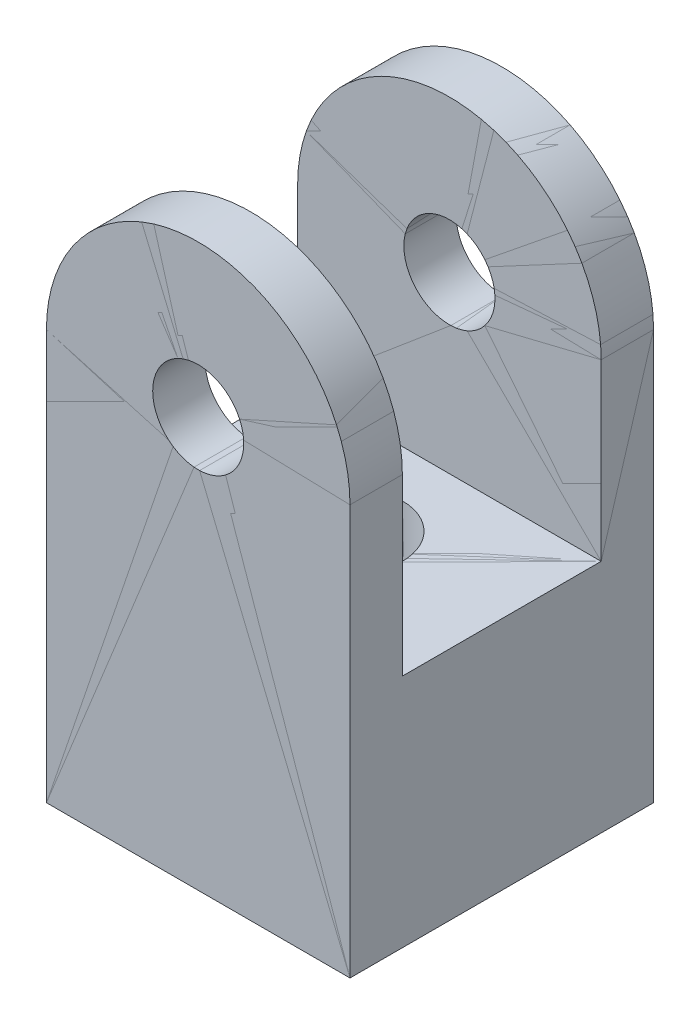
ISO-10303-21;
HEADER;
FILE_DESCRIPTION(('STEP AP214'),'2;1');
FILE_NAME('part.step','',(''),(''),'','','');
FILE_SCHEMA(('AUTOMOTIVE_DESIGN { 1 0 10303 214 1 1 1 1 }'));
ENDSEC;
DATA;
#1=APPLICATION_CONTEXT('core data for automotive mechanical design processes');
#2=APPLICATION_PROTOCOL_DEFINITION('international standard','automotive_design',2000,#1);
#3=PRODUCT_CONTEXT('',#1,'mechanical');
#4=PRODUCT('Part','Part','',(#3));
#5=PRODUCT_RELATED_PRODUCT_CATEGORY('part','',(#4));
#6=PRODUCT_DEFINITION_FORMATION('','',#4);
#7=PRODUCT_DEFINITION_CONTEXT('part definition',#1,'design');
#8=PRODUCT_DEFINITION('design','',#6,#7);
#9=PRODUCT_DEFINITION_SHAPE('','',#8);
#10=(LENGTH_UNIT() NAMED_UNIT(*) SI_UNIT(.MILLI.,.METRE.));
#11=(NAMED_UNIT(*) PLANE_ANGLE_UNIT() SI_UNIT($,.RADIAN.));
#12=(NAMED_UNIT(*) SI_UNIT($,.STERADIAN.) SOLID_ANGLE_UNIT());
#13=UNCERTAINTY_MEASURE_WITH_UNIT(LENGTH_MEASURE(1.E-05),#10,'distance_accuracy_value','');
#14=(GEOMETRIC_REPRESENTATION_CONTEXT(3) GLOBAL_UNCERTAINTY_ASSIGNED_CONTEXT((#13)) GLOBAL_UNIT_ASSIGNED_CONTEXT((#10,
#11,#12)) REPRESENTATION_CONTEXT('',''));
#15=CARTESIAN_POINT('',(0.,0.,0.));
#16=DIRECTION('',(0.,0.,1.));
#17=DIRECTION('',(1.,0.,0.));
#18=AXIS2_PLACEMENT_3D('',#15,#16,#17);
#19=CARTESIAN_POINT('',(-17.031251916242,-26.62500137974,-33.1));
#20=DIRECTION('',(0.,0.,-1.));
#21=DIRECTION('',(-1.,0.,0.));
#22=AXIS2_PLACEMENT_3D('',#19,#20,#21);
#23=CYLINDRICAL_SURFACE('',#22,6.00000000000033);
#24=CARTESIAN_POINT('',(-17.031251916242,-26.62500137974,-40.));
#25=DIRECTION('',(0.,0.,-1.));
#26=DIRECTION('',(-1.,0.,0.));
#27=AXIS2_PLACEMENT_3D('',#24,#25,#26);
#28=CIRCLE('',#27,6.00000000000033);
#29=CARTESIAN_POINT('',(-23.0312519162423,-26.62500137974,-40.));
#30=VERTEX_POINT('',#29);
#31=EDGE_CURVE('P0_E461',#30,#30,#28,.F.);
#32=ORIENTED_EDGE('',*,*,#31,.F.);
#33=EDGE_LOOP('',(#32));
#34=FACE_BOUND('',#33,.T.);
#35=CARTESIAN_POINT('',(-17.031251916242,-26.62500137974,-33.1));
#36=DIRECTION('',(0.,0.,-1.));
#37=DIRECTION('',(-1.,0.,0.));
#38=AXIS2_PLACEMENT_3D('',#35,#36,#37);
#39=CIRCLE('',#38,6.00000000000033);
#40=CARTESIAN_POINT('',(-23.0312519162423,-26.62500137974,-33.1));
#41=VERTEX_POINT('',#40);
#42=EDGE_CURVE('P0_E352',#41,#41,#39,.F.);
#43=ORIENTED_EDGE('',*,*,#42,.T.);
#44=EDGE_LOOP('',(#43));
#45=FACE_BOUND('',#44,.T.);
#46=ADVANCED_FACE('P0_F348',(#34,#45),#23,.F.);
#47=CARTESIAN_POINT('',(2.9687480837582,-49.62500137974,-6.9));
#48=DIRECTION('',(0.,-1.,0.));
#49=DIRECTION('',(-1.,0.,0.));
#50=AXIS2_PLACEMENT_3D('',#47,#48,#49);
#51=PLANE('',#50);
#52=CARTESIAN_POINT('',(-17.031251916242,-49.62500137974,-20.));
#53=DIRECTION('',(0.,-1.,0.));
#54=DIRECTION('',(0.,0.,-1.));
#55=AXIS2_PLACEMENT_3D('',#52,#53,#54);
#56=CIRCLE('',#55,6.90000000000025);
#57=CARTESIAN_POINT('',(-17.031251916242,-49.62500137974,-26.9000000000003));
#58=VERTEX_POINT('',#57);
#59=EDGE_CURVE('P0_E458',#58,#58,#56,.F.);
#60=ORIENTED_EDGE('',*,*,#59,.F.);
#61=EDGE_LOOP('',(#60));
#62=FACE_BOUND('',#61,.T.);
#63=DIRECTION('',(-1.,0.,0.));
#64=VECTOR('',#63,1.);
#65=CARTESIAN_POINT('',(-18.5312519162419,-49.62500137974,-33.1));
#66=LINE('',#65,#64);
#67=CARTESIAN_POINT('',(2.9687480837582,-49.6250013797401,-33.0999999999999));
#68=VERTEX_POINT('',#67);
#69=CARTESIAN_POINT('',(-37.031251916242,-49.6250013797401,-33.0999999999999));
#70=VERTEX_POINT('',#69);
#71=EDGE_CURVE('P0_E426',#68,#70,#66,.T.);
#72=ORIENTED_EDGE('',*,*,#71,.T.);
#73=DIRECTION('',(0.,0.,-1.));
#74=VECTOR('',#73,1.);
#75=CARTESIAN_POINT('',(-37.031251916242,-49.6250013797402,-27.));
#76=LINE('',#75,#74);
#77=CARTESIAN_POINT('',(-37.0312519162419,-49.6250013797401,-6.90000000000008));
#78=VERTEX_POINT('',#77);
#79=EDGE_CURVE('P0_E476',#78,#70,#76,.T.);
#80=ORIENTED_EDGE('',*,*,#79,.F.);
#81=DIRECTION('',(1.,0.,0.));
#82=VECTOR('',#81,1.);
#83=CARTESIAN_POINT('',(-18.5312519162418,-49.62500137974,-6.9));
#84=LINE('',#83,#82);
#85=CARTESIAN_POINT('',(2.96874808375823,-49.6250013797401,-6.90000000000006));
#86=VERTEX_POINT('',#85);
#87=EDGE_CURVE('P0_E437',#78,#86,#84,.T.);
#88=ORIENTED_EDGE('',*,*,#87,.T.);
#89=DIRECTION('',(0.,0.,1.));
#90=VECTOR('',#89,1.);
#91=CARTESIAN_POINT('',(2.9687480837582,-49.6250013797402,-27.));
#92=LINE('',#91,#90);
#93=EDGE_CURVE('P0_E430',#68,#86,#92,.T.);
#94=ORIENTED_EDGE('',*,*,#93,.F.);
#95=EDGE_LOOP('',(#72,#80,#88,#94));
#96=FACE_BOUND('',#95,.T.);
#97=ADVANCED_FACE('P0_F506',(#62,#96),#51,.F.);
#98=CARTESIAN_POINT('',(2.9687480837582,-49.62500137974,-33.1));
#99=DIRECTION('',(0.,0.,-1.));
#100=DIRECTION('',(-1.,0.,0.));
#101=AXIS2_PLACEMENT_3D('',#98,#99,#100);
#102=PLANE('',#101);
#103=ORIENTED_EDGE('',*,*,#42,.F.);
#104=EDGE_LOOP('',(#103));
#105=FACE_BOUND('',#104,.T.);
#106=CARTESIAN_POINT('',(-17.031251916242,-26.62500137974,-33.1));
#107=DIRECTION('',(0.,0.,1.));
#108=DIRECTION('',(1.,0.,0.));
#109=AXIS2_PLACEMENT_3D('',#106,#107,#108);
#110=CIRCLE('',#109,20.);
#111=CARTESIAN_POINT('',(2.9687480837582,-26.62500137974,-33.0999999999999));
#112=VERTEX_POINT('',#111);
#113=CARTESIAN_POINT('',(-37.031251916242,-26.62500137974,-33.0999999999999));
#114=VERTEX_POINT('',#113);
#115=EDGE_CURVE('P0_E411',#112,#114,#110,.T.);
#116=ORIENTED_EDGE('',*,*,#115,.T.);
#117=DIRECTION('',(0.,1.,0.));
#118=VECTOR('',#117,1.);
#119=CARTESIAN_POINT('',(-37.031251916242,-53.62500137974,-33.0999999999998));
#120=LINE('',#119,#118);
#121=EDGE_CURVE('P0_E474',#70,#114,#120,.T.);
#122=ORIENTED_EDGE('',*,*,#121,.F.);
#123=ORIENTED_EDGE('',*,*,#71,.F.);
#124=DIRECTION('',(0.,-1.,0.));
#125=VECTOR('',#124,1.);
#126=CARTESIAN_POINT('',(2.9687480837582,-53.62500137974,-33.0999999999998));
#127=LINE('',#126,#125);
#128=EDGE_CURVE('P0_E424',#112,#68,#127,.T.);
#129=ORIENTED_EDGE('',*,*,#128,.F.);
#130=EDGE_LOOP('',(#116,#122,#123,#129));
#131=FACE_BOUND('',#130,.T.);
#132=ADVANCED_FACE('P0_F425',(#105,#131),#102,.F.);
#133=CARTESIAN_POINT('',(-17.031251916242,-26.62500137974,-40.));
#134=DIRECTION('',(0.,0.,1.));
#135=DIRECTION('',(1.,0.,0.));
#136=AXIS2_PLACEMENT_3D('',#133,#134,#135);
#137=CYLINDRICAL_SURFACE('',#136,20.);
#138=CARTESIAN_POINT('',(-17.031251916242,-26.62500137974,-40.));
#139=DIRECTION('',(0.,0.,1.));
#140=DIRECTION('',(1.,0.,0.));
#141=AXIS2_PLACEMENT_3D('',#138,#139,#140);
#142=CIRCLE('',#141,20.);
#143=CARTESIAN_POINT('',(-37.031251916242,-26.62500137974,-40.));
#144=VERTEX_POINT('',#143);
#145=CARTESIAN_POINT('',(2.9687480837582,-26.62500137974,-40.));
#146=VERTEX_POINT('',#145);
#147=EDGE_CURVE('P0_E422',#144,#146,#142,.F.);
#148=ORIENTED_EDGE('',*,*,#147,.F.);
#149=DIRECTION('',(0.,0.,-1.));
#150=VECTOR('',#149,1.);
#151=CARTESIAN_POINT('',(-37.031251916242,-26.62500137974,-27.));
#152=LINE('',#151,#150);
#153=EDGE_CURVE('P0_E418',#114,#144,#152,.T.);
#154=ORIENTED_EDGE('',*,*,#153,.F.);
#155=ORIENTED_EDGE('',*,*,#115,.F.);
#156=DIRECTION('',(0.,0.,1.));
#157=VECTOR('',#156,1.);
#158=CARTESIAN_POINT('',(2.9687480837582,-26.62500137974,-27.));
#159=LINE('',#158,#157);
#160=EDGE_CURVE('P0_E415',#146,#112,#159,.T.);
#161=ORIENTED_EDGE('',*,*,#160,.F.);
#162=EDGE_LOOP('',(#148,#154,#155,#161));
#163=FACE_BOUND('',#162,.T.);
#164=ADVANCED_FACE('P0_F413',(#163),#137,.T.);
#165=CARTESIAN_POINT('',(2.9687480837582,-80.62500137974,-40.));
#166=DIRECTION('',(0.,0.,-1.));
#167=DIRECTION('',(-1.,0.,0.));
#168=AXIS2_PLACEMENT_3D('',#165,#166,#167);
#169=PLANE('',#168);
#170=ORIENTED_EDGE('',*,*,#31,.T.);
#171=EDGE_LOOP('',(#170));
#172=FACE_BOUND('',#171,.T.);
#173=ORIENTED_EDGE('',*,*,#147,.T.);
#174=DIRECTION('',(0.,1.,0.));
#175=VECTOR('',#174,1.);
#176=CARTESIAN_POINT('',(2.9687480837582,-53.62500137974,-40.));
#177=LINE('',#176,#175);
#178=CARTESIAN_POINT('',(2.9687480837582,-80.62500137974,-40.));
#179=VERTEX_POINT('',#178);
#180=EDGE_CURVE('P0_E435',#179,#146,#177,.T.);
#181=ORIENTED_EDGE('',*,*,#180,.F.);
#182=DIRECTION('',(1.,0.,0.));
#183=VECTOR('',#182,1.);
#184=CARTESIAN_POINT('',(-17.0312519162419,-80.62500137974,-40.));
#185=LINE('',#184,#183);
#186=CARTESIAN_POINT('',(-37.031251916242,-80.62500137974,-40.));
#187=VERTEX_POINT('',#186);
#188=EDGE_CURVE('P0_E470',#187,#179,#185,.T.);
#189=ORIENTED_EDGE('',*,*,#188,.F.);
#190=DIRECTION('',(0.,-1.,0.));
#191=VECTOR('',#190,1.);
#192=CARTESIAN_POINT('',(-37.031251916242,-53.62500137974,-40.));
#193=LINE('',#192,#191);
#194=EDGE_CURVE('P0_E468',#144,#187,#193,.T.);
#195=ORIENTED_EDGE('',*,*,#194,.F.);
#196=EDGE_LOOP('',(#173,#181,#189,#195));
#197=FACE_BOUND('',#196,.T.);
#198=ADVANCED_FACE('P0_F466',(#172,#197),#169,.T.);
#199=CARTESIAN_POINT('',(-17.031251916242,-49.62500137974,-20.));
#200=DIRECTION('',(0.,-1.,0.));
#201=DIRECTION('',(0.,0.,-1.));
#202=AXIS2_PLACEMENT_3D('',#199,#200,#201);
#203=CYLINDRICAL_SURFACE('',#202,6.90000000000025);
#204=ORIENTED_EDGE('',*,*,#59,.T.);
#205=EDGE_LOOP('',(#204));
#206=FACE_BOUND('',#205,.T.);
#207=CARTESIAN_POINT('',(-17.031251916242,-80.62500137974,-20.));
#208=DIRECTION('',(0.,-1.,0.));
#209=DIRECTION('',(0.,0.,-1.));
#210=AXIS2_PLACEMENT_3D('',#207,#208,#209);
#211=CIRCLE('',#210,6.90000000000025);
#212=CARTESIAN_POINT('',(-17.031251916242,-80.62500137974,-26.9000000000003));
#213=VERTEX_POINT('',#212);
#214=EDGE_CURVE('P0_E450',#213,#213,#211,.F.);
#215=ORIENTED_EDGE('',*,*,#214,.F.);
#216=EDGE_LOOP('',(#215));
#217=FACE_BOUND('',#216,.T.);
#218=ADVANCED_FACE('P0_F590',(#206,#217),#203,.F.);
#219=CARTESIAN_POINT('',(2.9687480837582,-6.6250013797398,-6.9));
#220=DIRECTION('',(0.,0.,1.));
#221=DIRECTION('',(-1.,0.,0.));
#222=AXIS2_PLACEMENT_3D('',#219,#220,#221);
#223=PLANE('',#222);
#224=CARTESIAN_POINT('',(-17.031251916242,-26.62500137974,-6.9));
#225=DIRECTION('',(0.,0.,-1.));
#226=DIRECTION('',(-1.,0.,0.));
#227=AXIS2_PLACEMENT_3D('',#224,#225,#226);
#228=CIRCLE('',#227,6.00000000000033);
#229=CARTESIAN_POINT('',(-23.0312519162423,-26.62500137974,-6.9));
#230=VERTEX_POINT('',#229);
#231=EDGE_CURVE('P0_E447',#230,#230,#228,.T.);
#232=ORIENTED_EDGE('',*,*,#231,.F.);
#233=EDGE_LOOP('',(#232));
#234=FACE_BOUND('',#233,.T.);
#235=ORIENTED_EDGE('',*,*,#87,.F.);
#236=DIRECTION('',(0.,-1.,0.));
#237=VECTOR('',#236,1.);
#238=CARTESIAN_POINT('',(-37.031251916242,-53.62500137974,-6.90000000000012));
#239=LINE('',#238,#237);
#240=CARTESIAN_POINT('',(-37.031251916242,-26.62500137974,-6.90000000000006));
#241=VERTEX_POINT('',#240);
#242=EDGE_CURVE('P0_E487',#241,#78,#239,.T.);
#243=ORIENTED_EDGE('',*,*,#242,.F.);
#244=CARTESIAN_POINT('',(-17.031251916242,-26.62500137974,-6.9));
#245=DIRECTION('',(0.,0.,1.));
#246=DIRECTION('',(1.,0.,0.));
#247=AXIS2_PLACEMENT_3D('',#244,#245,#246);
#248=CIRCLE('',#247,20.);
#249=CARTESIAN_POINT('',(2.9687480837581,-26.62500137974,-6.9));
#250=VERTEX_POINT('',#249);
#251=EDGE_CURVE('P0_E454',#241,#250,#248,.F.);
#252=ORIENTED_EDGE('',*,*,#251,.T.);
#253=DIRECTION('',(0.,1.,0.));
#254=VECTOR('',#253,1.);
#255=CARTESIAN_POINT('',(2.9687480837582,-53.62500137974,-6.90000000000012));
#256=LINE('',#255,#254);
#257=EDGE_CURVE('P0_E457',#86,#250,#256,.T.);
#258=ORIENTED_EDGE('',*,*,#257,.F.);
#259=EDGE_LOOP('',(#235,#243,#252,#258));
#260=FACE_BOUND('',#259,.T.);
#261=ADVANCED_FACE('P0_F510',(#234,#260),#223,.F.);
#262=CARTESIAN_POINT('',(2.9687480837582,-80.62500137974,0.));
#263=DIRECTION('',(1.,0.,0.));
#264=DIRECTION('',(0.,0.,-1.));
#265=AXIS2_PLACEMENT_3D('',#262,#263,#264);
#266=PLANE('',#265);
#267=ORIENTED_EDGE('',*,*,#257,.T.);
#268=DIRECTION('',(0.,0.,1.));
#269=VECTOR('',#268,1.);
#270=CARTESIAN_POINT('',(2.96874808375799,-26.6250013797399,-20.));
#271=LINE('',#270,#269);
#272=CARTESIAN_POINT('',(2.96874808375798,-26.62500137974,0.));
#273=VERTEX_POINT('',#272);
#274=EDGE_CURVE('P0_E456',#250,#273,#271,.T.);
#275=ORIENTED_EDGE('',*,*,#274,.T.);
#276=DIRECTION('',(0.,1.,0.));
#277=VECTOR('',#276,1.);
#278=CARTESIAN_POINT('',(2.96874808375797,-43.6250013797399,0.));
#279=LINE('',#278,#277);
#280=CARTESIAN_POINT('',(2.96874808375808,-80.62500137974,0.));
#281=VERTEX_POINT('',#280);
#282=EDGE_CURVE('P0_E446',#281,#273,#279,.T.);
#283=ORIENTED_EDGE('',*,*,#282,.F.);
#284=DIRECTION('',(0.,0.,1.));
#285=VECTOR('',#284,1.);
#286=CARTESIAN_POINT('',(2.9687480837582,-80.62500137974,-20.));
#287=LINE('',#286,#285);
#288=EDGE_CURVE('P0_E453',#179,#281,#287,.T.);
#289=ORIENTED_EDGE('',*,*,#288,.F.);
#290=ORIENTED_EDGE('',*,*,#180,.T.);
#291=ORIENTED_EDGE('',*,*,#160,.T.);
#292=ORIENTED_EDGE('',*,*,#128,.T.);
#293=ORIENTED_EDGE('',*,*,#93,.T.);
#294=EDGE_LOOP('',(#267,#275,#283,#289,#290,#291,#292,#293));
#295=FACE_BOUND('',#294,.T.);
#296=ADVANCED_FACE('P0_F433',(#295),#266,.T.);
#297=CARTESIAN_POINT('',(-17.031251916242,-26.62500137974,-6.9));
#298=DIRECTION('',(0.,0.,1.));
#299=DIRECTION('',(1.,0.,0.));
#300=AXIS2_PLACEMENT_3D('',#297,#298,#299);
#301=CYLINDRICAL_SURFACE('',#300,20.);
#302=ORIENTED_EDGE('',*,*,#274,.F.);
#303=ORIENTED_EDGE('',*,*,#251,.F.);
#304=DIRECTION('',(0.,0.,-1.));
#305=VECTOR('',#304,1.);
#306=CARTESIAN_POINT('',(-37.031251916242,-26.62500137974,-27.));
#307=LINE('',#306,#305);
#308=CARTESIAN_POINT('',(-37.031251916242,-26.62500137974,0.));
#309=VERTEX_POINT('',#308);
#310=EDGE_CURVE('P0_E492',#309,#241,#307,.T.);
#311=ORIENTED_EDGE('',*,*,#310,.F.);
#312=CARTESIAN_POINT('',(-17.031251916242,-26.62500137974,0.));
#313=DIRECTION('',(0.,0.,1.));
#314=DIRECTION('',(1.,0.,0.));
#315=AXIS2_PLACEMENT_3D('',#312,#313,#314);
#316=CIRCLE('',#315,20.);
#317=EDGE_CURVE('P0_E442',#273,#309,#316,.T.);
#318=ORIENTED_EDGE('',*,*,#317,.F.);
#319=EDGE_LOOP('',(#302,#303,#311,#318));
#320=FACE_BOUND('',#319,.T.);
#321=ADVANCED_FACE('P0_F513',(#320),#301,.T.);
#322=CARTESIAN_POINT('',(-37.031251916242,-26.62500137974,0.));
#323=DIRECTION('',(-1.,0.,0.));
#324=DIRECTION('',(0.,0.,-1.));
#325=AXIS2_PLACEMENT_3D('',#322,#323,#324);
#326=PLANE('',#325);
#327=ORIENTED_EDGE('',*,*,#194,.T.);
#328=DIRECTION('',(0.,0.,-1.));
#329=VECTOR('',#328,1.);
#330=CARTESIAN_POINT('',(-37.031251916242,-80.62500137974,-20.));
#331=LINE('',#330,#329);
#332=CARTESIAN_POINT('',(-37.031251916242,-80.62500137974,0.));
#333=VERTEX_POINT('',#332);
#334=EDGE_CURVE('P0_E367',#333,#187,#331,.T.);
#335=ORIENTED_EDGE('',*,*,#334,.F.);
#336=DIRECTION('',(0.,-1.,0.));
#337=VECTOR('',#336,1.);
#338=CARTESIAN_POINT('',(-37.031251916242,-43.6250013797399,0.));
#339=LINE('',#338,#337);
#340=EDGE_CURVE('P0_E445',#309,#333,#339,.T.);
#341=ORIENTED_EDGE('',*,*,#340,.F.);
#342=ORIENTED_EDGE('',*,*,#310,.T.);
#343=ORIENTED_EDGE('',*,*,#242,.T.);
#344=ORIENTED_EDGE('',*,*,#79,.T.);
#345=ORIENTED_EDGE('',*,*,#121,.T.);
#346=ORIENTED_EDGE('',*,*,#153,.T.);
#347=EDGE_LOOP('',(#327,#335,#341,#342,#343,#344,#345,#346));
#348=FACE_BOUND('',#347,.T.);
#349=ADVANCED_FACE('P0_F472',(#348),#326,.T.);
#350=CARTESIAN_POINT('',(-37.031251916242,-80.62500137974,0.));
#351=DIRECTION('',(0.,-1.,0.));
#352=DIRECTION('',(0.,0.,-1.));
#353=AXIS2_PLACEMENT_3D('',#350,#351,#352);
#354=PLANE('',#353);
#355=ORIENTED_EDGE('',*,*,#214,.T.);
#356=EDGE_LOOP('',(#355));
#357=FACE_BOUND('',#356,.T.);
#358=ORIENTED_EDGE('',*,*,#188,.T.);
#359=ORIENTED_EDGE('',*,*,#288,.T.);
#360=DIRECTION('',(1.,0.,0.));
#361=VECTOR('',#360,1.);
#362=CARTESIAN_POINT('',(-0.031251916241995,-80.62500137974,0.));
#363=LINE('',#362,#361);
#364=EDGE_CURVE('P0_E358',#333,#281,#363,.T.);
#365=ORIENTED_EDGE('',*,*,#364,.F.);
#366=ORIENTED_EDGE('',*,*,#334,.T.);
#367=EDGE_LOOP('',(#358,#359,#365,#366));
#368=FACE_BOUND('',#367,.T.);
#369=ADVANCED_FACE('P0_F544',(#357,#368),#354,.T.);
#370=CARTESIAN_POINT('',(-17.031251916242,-26.62500137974,0.));
#371=DIRECTION('',(0.,0.,-1.));
#372=DIRECTION('',(-1.,0.,0.));
#373=AXIS2_PLACEMENT_3D('',#370,#371,#372);
#374=CYLINDRICAL_SURFACE('',#373,6.00000000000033);
#375=ORIENTED_EDGE('',*,*,#231,.T.);
#376=EDGE_LOOP('',(#375));
#377=FACE_BOUND('',#376,.T.);
#378=CARTESIAN_POINT('',(-17.031251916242,-26.62500137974,0.));
#379=DIRECTION('',(0.,0.,-1.));
#380=DIRECTION('',(-1.,0.,0.));
#381=AXIS2_PLACEMENT_3D('',#378,#379,#380);
#382=CIRCLE('',#381,6.00000000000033);
#383=CARTESIAN_POINT('',(-23.0312519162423,-26.62500137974,0.));
#384=VERTEX_POINT('',#383);
#385=EDGE_CURVE('P0_E11',#384,#384,#382,.T.);
#386=ORIENTED_EDGE('',*,*,#385,.F.);
#387=EDGE_LOOP('',(#386));
#388=FACE_BOUND('',#387,.T.);
#389=ADVANCED_FACE('P0_F546',(#377,#388),#374,.F.);
#390=CARTESIAN_POINT('',(-37.031251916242,-80.62500137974,0.));
#391=DIRECTION('',(0.,0.,1.));
#392=DIRECTION('',(1.,0.,0.));
#393=AXIS2_PLACEMENT_3D('',#390,#391,#392);
#394=PLANE('',#393);
#395=ORIENTED_EDGE('',*,*,#385,.T.);
#396=EDGE_LOOP('',(#395));
#397=FACE_BOUND('',#396,.T.);
#398=ORIENTED_EDGE('',*,*,#340,.T.);
#399=ORIENTED_EDGE('',*,*,#364,.T.);
#400=ORIENTED_EDGE('',*,*,#282,.T.);
#401=ORIENTED_EDGE('',*,*,#317,.T.);
#402=EDGE_LOOP('',(#398,#399,#400,#401));
#403=FACE_BOUND('',#402,.T.);
#404=ADVANCED_FACE('P0_F350',(#397,#403),#394,.T.);
#405=CLOSED_SHELL('',(#46,#97,#132,#164,#198,#218,#261,#296,#321,#349,#369,#389,#404));
#406=MANIFOLD_SOLID_BREP('P0_B2',#405);
#407=CARTESIAN_POINT('',(-17.031251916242,-26.62500137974,-33.1));
#408=DIRECTION('',(0.,0.,-1.));
#409=DIRECTION('',(-1.,0.,0.));
#410=AXIS2_PLACEMENT_3D('',#407,#408,#409);
#411=CYLINDRICAL_SURFACE('',#410,6.00000000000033);
#412=CARTESIAN_POINT('',(-17.031251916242,-26.62500137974,-40.));
#413=DIRECTION('',(0.,0.,-1.));
#414=DIRECTION('',(-1.,0.,0.));
#415=AXIS2_PLACEMENT_3D('',#412,#413,#414);
#416=CIRCLE('',#415,6.00000000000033);
#417=CARTESIAN_POINT('',(-23.0312519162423,-26.62500137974,-40.));
#418=VERTEX_POINT('',#417);
#419=EDGE_CURVE('P1_E128',#418,#418,#416,.F.);
#420=ORIENTED_EDGE('',*,*,#419,.F.);
#421=EDGE_LOOP('',(#420));
#422=FACE_BOUND('',#421,.T.);
#423=CARTESIAN_POINT('',(-17.031251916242,-26.62500137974,-33.1));
#424=DIRECTION('',(0.,0.,-1.));
#425=DIRECTION('',(-1.,0.,0.));
#426=AXIS2_PLACEMENT_3D('',#423,#424,#425);
#427=CIRCLE('',#426,6.00000000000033);
#428=CARTESIAN_POINT('',(-23.0312519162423,-26.62500137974,-33.1));
#429=VERTEX_POINT('',#428);
#430=EDGE_CURVE('P1_E19',#429,#429,#427,.F.);
#431=ORIENTED_EDGE('',*,*,#430,.T.);
#432=EDGE_LOOP('',(#431));
#433=FACE_BOUND('',#432,.T.);
#434=ADVANCED_FACE('P1_F15',(#422,#433),#411,.F.);
#435=CARTESIAN_POINT('',(2.9687480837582,-49.62500137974,-6.9));
#436=DIRECTION('',(0.,-1.,0.));
#437=DIRECTION('',(-1.,0.,0.));
#438=AXIS2_PLACEMENT_3D('',#435,#436,#437);
#439=PLANE('',#438);
#440=CARTESIAN_POINT('',(-17.031251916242,-49.62500137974,-20.));
#441=DIRECTION('',(0.,-1.,0.));
#442=DIRECTION('',(0.,0.,-1.));
#443=AXIS2_PLACEMENT_3D('',#440,#441,#442);
#444=CIRCLE('',#443,6.90000000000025);
#445=CARTESIAN_POINT('',(-17.031251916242,-49.62500137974,-26.9000000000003));
#446=VERTEX_POINT('',#445);
#447=EDGE_CURVE('P1_E125',#446,#446,#444,.F.);
#448=ORIENTED_EDGE('',*,*,#447,.F.);
#449=EDGE_LOOP('',(#448));
#450=FACE_BOUND('',#449,.T.);
#451=DIRECTION('',(-1.,0.,0.));
#452=VECTOR('',#451,1.);
#453=CARTESIAN_POINT('',(-18.5312519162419,-49.62500137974,-33.1));
#454=LINE('',#453,#452);
#455=CARTESIAN_POINT('',(2.9687480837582,-49.6250013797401,-33.0999999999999));
#456=VERTEX_POINT('',#455);
#457=CARTESIAN_POINT('',(-37.031251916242,-49.6250013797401,-33.0999999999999));
#458=VERTEX_POINT('',#457);
#459=EDGE_CURVE('P1_E93',#456,#458,#454,.T.);
#460=ORIENTED_EDGE('',*,*,#459,.T.);
#461=DIRECTION('',(0.,0.,-1.));
#462=VECTOR('',#461,1.);
#463=CARTESIAN_POINT('',(-37.031251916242,-49.6250013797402,-27.));
#464=LINE('',#463,#462);
#465=CARTESIAN_POINT('',(-37.0312519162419,-49.6250013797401,-6.90000000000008));
#466=VERTEX_POINT('',#465);
#467=EDGE_CURVE('P1_E143',#466,#458,#464,.T.);
#468=ORIENTED_EDGE('',*,*,#467,.F.);
#469=DIRECTION('',(1.,0.,0.));
#470=VECTOR('',#469,1.);
#471=CARTESIAN_POINT('',(-18.5312519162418,-49.62500137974,-6.9));
#472=LINE('',#471,#470);
#473=CARTESIAN_POINT('',(2.96874808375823,-49.6250013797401,-6.90000000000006));
#474=VERTEX_POINT('',#473);
#475=EDGE_CURVE('P1_E104',#466,#474,#472,.T.);
#476=ORIENTED_EDGE('',*,*,#475,.T.);
#477=DIRECTION('',(0.,0.,1.));
#478=VECTOR('',#477,1.);
#479=CARTESIAN_POINT('',(2.9687480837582,-49.6250013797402,-27.));
#480=LINE('',#479,#478);
#481=EDGE_CURVE('P1_E97',#456,#474,#480,.T.);
#482=ORIENTED_EDGE('',*,*,#481,.F.);
#483=EDGE_LOOP('',(#460,#468,#476,#482));
#484=FACE_BOUND('',#483,.T.);
#485=ADVANCED_FACE('P1_F173',(#450,#484),#439,.F.);
#486=CARTESIAN_POINT('',(2.9687480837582,-49.62500137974,-33.1));
#487=DIRECTION('',(0.,0.,-1.));
#488=DIRECTION('',(-1.,0.,0.));
#489=AXIS2_PLACEMENT_3D('',#486,#487,#488);
#490=PLANE('',#489);
#491=ORIENTED_EDGE('',*,*,#430,.F.);
#492=EDGE_LOOP('',(#491));
#493=FACE_BOUND('',#492,.T.);
#494=CARTESIAN_POINT('',(-17.031251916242,-26.62500137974,-33.1));
#495=DIRECTION('',(0.,0.,1.));
#496=DIRECTION('',(1.,0.,0.));
#497=AXIS2_PLACEMENT_3D('',#494,#495,#496);
#498=CIRCLE('',#497,20.);
#499=CARTESIAN_POINT('',(2.9687480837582,-26.62500137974,-33.0999999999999));
#500=VERTEX_POINT('',#499);
#501=CARTESIAN_POINT('',(-37.031251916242,-26.62500137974,-33.0999999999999));
#502=VERTEX_POINT('',#501);
#503=EDGE_CURVE('P1_E78',#500,#502,#498,.T.);
#504=ORIENTED_EDGE('',*,*,#503,.T.);
#505=DIRECTION('',(0.,1.,0.));
#506=VECTOR('',#505,1.);
#507=CARTESIAN_POINT('',(-37.031251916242,-53.62500137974,-33.0999999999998));
#508=LINE('',#507,#506);
#509=EDGE_CURVE('P1_E141',#458,#502,#508,.T.);
#510=ORIENTED_EDGE('',*,*,#509,.F.);
#511=ORIENTED_EDGE('',*,*,#459,.F.);
#512=DIRECTION('',(0.,-1.,0.));
#513=VECTOR('',#512,1.);
#514=CARTESIAN_POINT('',(2.9687480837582,-53.62500137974,-33.0999999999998));
#515=LINE('',#514,#513);
#516=EDGE_CURVE('P1_E91',#500,#456,#515,.T.);
#517=ORIENTED_EDGE('',*,*,#516,.F.);
#518=EDGE_LOOP('',(#504,#510,#511,#517));
#519=FACE_BOUND('',#518,.T.);
#520=ADVANCED_FACE('P1_F92',(#493,#519),#490,.F.);
#521=CARTESIAN_POINT('',(-17.031251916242,-26.62500137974,-40.));
#522=DIRECTION('',(0.,0.,1.));
#523=DIRECTION('',(1.,0.,0.));
#524=AXIS2_PLACEMENT_3D('',#521,#522,#523);
#525=CYLINDRICAL_SURFACE('',#524,20.);
#526=CARTESIAN_POINT('',(-17.031251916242,-26.62500137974,-40.));
#527=DIRECTION('',(0.,0.,1.));
#528=DIRECTION('',(1.,0.,0.));
#529=AXIS2_PLACEMENT_3D('',#526,#527,#528);
#530=CIRCLE('',#529,20.);
#531=CARTESIAN_POINT('',(-37.031251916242,-26.62500137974,-40.));
#532=VERTEX_POINT('',#531);
#533=CARTESIAN_POINT('',(2.9687480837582,-26.62500137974,-40.));
#534=VERTEX_POINT('',#533);
#535=EDGE_CURVE('P1_E89',#532,#534,#530,.F.);
#536=ORIENTED_EDGE('',*,*,#535,.F.);
#537=DIRECTION('',(0.,0.,-1.));
#538=VECTOR('',#537,1.);
#539=CARTESIAN_POINT('',(-37.031251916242,-26.62500137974,-27.));
#540=LINE('',#539,#538);
#541=EDGE_CURVE('P1_E85',#502,#532,#540,.T.);
#542=ORIENTED_EDGE('',*,*,#541,.F.);
#543=ORIENTED_EDGE('',*,*,#503,.F.);
#544=DIRECTION('',(0.,0.,1.));
#545=VECTOR('',#544,1.);
#546=CARTESIAN_POINT('',(2.9687480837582,-26.62500137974,-27.));
#547=LINE('',#546,#545);
#548=EDGE_CURVE('P1_E82',#534,#500,#547,.T.);
#549=ORIENTED_EDGE('',*,*,#548,.F.);
#550=EDGE_LOOP('',(#536,#542,#543,#549));
#551=FACE_BOUND('',#550,.T.);
#552=ADVANCED_FACE('P1_F80',(#551),#525,.T.);
#553=CARTESIAN_POINT('',(2.9687480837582,-80.62500137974,-40.));
#554=DIRECTION('',(0.,0.,-1.));
#555=DIRECTION('',(-1.,0.,0.));
#556=AXIS2_PLACEMENT_3D('',#553,#554,#555);
#557=PLANE('',#556);
#558=ORIENTED_EDGE('',*,*,#419,.T.);
#559=EDGE_LOOP('',(#558));
#560=FACE_BOUND('',#559,.T.);
#561=ORIENTED_EDGE('',*,*,#535,.T.);
#562=DIRECTION('',(0.,1.,0.));
#563=VECTOR('',#562,1.);
#564=CARTESIAN_POINT('',(2.9687480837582,-53.62500137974,-40.));
#565=LINE('',#564,#563);
#566=CARTESIAN_POINT('',(2.9687480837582,-80.62500137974,-40.));
#567=VERTEX_POINT('',#566);
#568=EDGE_CURVE('P1_E102',#567,#534,#565,.T.);
#569=ORIENTED_EDGE('',*,*,#568,.F.);
#570=DIRECTION('',(1.,0.,0.));
#571=VECTOR('',#570,1.);
#572=CARTESIAN_POINT('',(-17.0312519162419,-80.62500137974,-40.));
#573=LINE('',#572,#571);
#574=CARTESIAN_POINT('',(-37.031251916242,-80.62500137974,-40.));
#575=VERTEX_POINT('',#574);
#576=EDGE_CURVE('P1_E137',#575,#567,#573,.T.);
#577=ORIENTED_EDGE('',*,*,#576,.F.);
#578=DIRECTION('',(0.,-1.,0.));
#579=VECTOR('',#578,1.);
#580=CARTESIAN_POINT('',(-37.031251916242,-53.62500137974,-40.));
#581=LINE('',#580,#579);
#582=EDGE_CURVE('P1_E135',#532,#575,#581,.T.);
#583=ORIENTED_EDGE('',*,*,#582,.F.);
#584=EDGE_LOOP('',(#561,#569,#577,#583));
#585=FACE_BOUND('',#584,.T.);
#586=ADVANCED_FACE('P1_F133',(#560,#585),#557,.T.);
#587=CARTESIAN_POINT('',(-17.031251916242,-49.62500137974,-20.));
#588=DIRECTION('',(0.,-1.,0.));
#589=DIRECTION('',(0.,0.,-1.));
#590=AXIS2_PLACEMENT_3D('',#587,#588,#589);
#591=CYLINDRICAL_SURFACE('',#590,6.90000000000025);
#592=ORIENTED_EDGE('',*,*,#447,.T.);
#593=EDGE_LOOP('',(#592));
#594=FACE_BOUND('',#593,.T.);
#595=CARTESIAN_POINT('',(-17.031251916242,-80.62500137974,-20.));
#596=DIRECTION('',(0.,-1.,0.));
#597=DIRECTION('',(0.,0.,-1.));
#598=AXIS2_PLACEMENT_3D('',#595,#596,#597);
#599=CIRCLE('',#598,6.90000000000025);
#600=CARTESIAN_POINT('',(-17.031251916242,-80.62500137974,-26.9000000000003));
#601=VERTEX_POINT('',#600);
#602=EDGE_CURVE('P1_E117',#601,#601,#599,.F.);
#603=ORIENTED_EDGE('',*,*,#602,.F.);
#604=EDGE_LOOP('',(#603));
#605=FACE_BOUND('',#604,.T.);
#606=ADVANCED_FACE('P1_F239',(#594,#605),#591,.F.);
#607=CARTESIAN_POINT('',(2.9687480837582,-6.6250013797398,-6.9));
#608=DIRECTION('',(0.,0.,1.));
#609=DIRECTION('',(-1.,0.,0.));
#610=AXIS2_PLACEMENT_3D('',#607,#608,#609);
#611=PLANE('',#610);
#612=CARTESIAN_POINT('',(-17.031251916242,-26.62500137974,-6.9));
#613=DIRECTION('',(0.,0.,-1.));
#614=DIRECTION('',(-1.,0.,0.));
#615=AXIS2_PLACEMENT_3D('',#612,#613,#614);
#616=CIRCLE('',#615,6.00000000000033);
#617=CARTESIAN_POINT('',(-23.0312519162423,-26.62500137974,-6.9));
#618=VERTEX_POINT('',#617);
#619=EDGE_CURVE('P1_E114',#618,#618,#616,.T.);
#620=ORIENTED_EDGE('',*,*,#619,.F.);
#621=EDGE_LOOP('',(#620));
#622=FACE_BOUND('',#621,.T.);
#623=ORIENTED_EDGE('',*,*,#475,.F.);
#624=DIRECTION('',(0.,-1.,0.));
#625=VECTOR('',#624,1.);
#626=CARTESIAN_POINT('',(-37.031251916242,-53.62500137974,-6.90000000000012));
#627=LINE('',#626,#625);
#628=CARTESIAN_POINT('',(-37.031251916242,-26.62500137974,-6.90000000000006));
#629=VERTEX_POINT('',#628);
#630=EDGE_CURVE('P1_E154',#629,#466,#627,.T.);
#631=ORIENTED_EDGE('',*,*,#630,.F.);
#632=CARTESIAN_POINT('',(-17.031251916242,-26.62500137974,-6.9));
#633=DIRECTION('',(0.,0.,1.));
#634=DIRECTION('',(1.,0.,0.));
#635=AXIS2_PLACEMENT_3D('',#632,#633,#634);
#636=CIRCLE('',#635,20.);
#637=CARTESIAN_POINT('',(2.9687480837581,-26.62500137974,-6.9));
#638=VERTEX_POINT('',#637);
#639=EDGE_CURVE('P1_E121',#629,#638,#636,.F.);
#640=ORIENTED_EDGE('',*,*,#639,.T.);
#641=DIRECTION('',(0.,1.,0.));
#642=VECTOR('',#641,1.);
#643=CARTESIAN_POINT('',(2.9687480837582,-53.62500137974,-6.90000000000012));
#644=LINE('',#643,#642);
#645=EDGE_CURVE('P1_E124',#474,#638,#644,.T.);
#646=ORIENTED_EDGE('',*,*,#645,.F.);
#647=EDGE_LOOP('',(#623,#631,#640,#646));
#648=FACE_BOUND('',#647,.T.);
#649=ADVANCED_FACE('P1_F177',(#622,#648),#611,.F.);
#650=CARTESIAN_POINT('',(2.9687480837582,-80.62500137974,0.));
#651=DIRECTION('',(1.,0.,0.));
#652=DIRECTION('',(0.,0.,-1.));
#653=AXIS2_PLACEMENT_3D('',#650,#651,#652);
#654=PLANE('',#653);
#655=ORIENTED_EDGE('',*,*,#645,.T.);
#656=DIRECTION('',(0.,0.,1.));
#657=VECTOR('',#656,1.);
#658=CARTESIAN_POINT('',(2.96874808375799,-26.6250013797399,-20.));
#659=LINE('',#658,#657);
#660=CARTESIAN_POINT('',(2.96874808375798,-26.62500137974,0.));
#661=VERTEX_POINT('',#660);
#662=EDGE_CURVE('P1_E123',#638,#661,#659,.T.);
#663=ORIENTED_EDGE('',*,*,#662,.T.);
#664=DIRECTION('',(0.,1.,0.));
#665=VECTOR('',#664,1.);
#666=CARTESIAN_POINT('',(2.96874808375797,-43.6250013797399,0.));
#667=LINE('',#666,#665);
#668=CARTESIAN_POINT('',(2.96874808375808,-80.62500137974,0.));
#669=VERTEX_POINT('',#668);
#670=EDGE_CURVE('P1_E113',#669,#661,#667,.T.);
#671=ORIENTED_EDGE('',*,*,#670,.F.);
#672=DIRECTION('',(0.,0.,1.));
#673=VECTOR('',#672,1.);
#674=CARTESIAN_POINT('',(2.9687480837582,-80.62500137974,-20.));
#675=LINE('',#674,#673);
#676=EDGE_CURVE('P1_E120',#567,#669,#675,.T.);
#677=ORIENTED_EDGE('',*,*,#676,.F.);
#678=ORIENTED_EDGE('',*,*,#568,.T.);
#679=ORIENTED_EDGE('',*,*,#548,.T.);
#680=ORIENTED_EDGE('',*,*,#516,.T.);
#681=ORIENTED_EDGE('',*,*,#481,.T.);
#682=EDGE_LOOP('',(#655,#663,#671,#677,#678,#679,#680,#681));
#683=FACE_BOUND('',#682,.T.);
#684=ADVANCED_FACE('P1_F100',(#683),#654,.T.);
#685=CARTESIAN_POINT('',(-17.031251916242,-26.62500137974,-6.9));
#686=DIRECTION('',(0.,0.,1.));
#687=DIRECTION('',(1.,0.,0.));
#688=AXIS2_PLACEMENT_3D('',#685,#686,#687);
#689=CYLINDRICAL_SURFACE('',#688,20.);
#690=ORIENTED_EDGE('',*,*,#662,.F.);
#691=ORIENTED_EDGE('',*,*,#639,.F.);
#692=DIRECTION('',(0.,0.,-1.));
#693=VECTOR('',#692,1.);
#694=CARTESIAN_POINT('',(-37.031251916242,-26.62500137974,-27.));
#695=LINE('',#694,#693);
#696=CARTESIAN_POINT('',(-37.031251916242,-26.62500137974,0.));
#697=VERTEX_POINT('',#696);
#698=EDGE_CURVE('P1_E159',#697,#629,#695,.T.);
#699=ORIENTED_EDGE('',*,*,#698,.F.);
#700=CARTESIAN_POINT('',(-17.031251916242,-26.62500137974,0.));
#701=DIRECTION('',(0.,0.,1.));
#702=DIRECTION('',(1.,0.,0.));
#703=AXIS2_PLACEMENT_3D('',#700,#701,#702);
#704=CIRCLE('',#703,20.);
#705=EDGE_CURVE('P1_E109',#661,#697,#704,.T.);
#706=ORIENTED_EDGE('',*,*,#705,.F.);
#707=EDGE_LOOP('',(#690,#691,#699,#706));
#708=FACE_BOUND('',#707,.T.);
#709=ADVANCED_FACE('P1_F180',(#708),#689,.T.);
#710=CARTESIAN_POINT('',(-37.031251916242,-26.62500137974,0.));
#711=DIRECTION('',(-1.,0.,0.));
#712=DIRECTION('',(0.,0.,-1.));
#713=AXIS2_PLACEMENT_3D('',#710,#711,#712);
#714=PLANE('',#713);
#715=ORIENTED_EDGE('',*,*,#582,.T.);
#716=DIRECTION('',(0.,0.,-1.));
#717=VECTOR('',#716,1.);
#718=CARTESIAN_POINT('',(-37.031251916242,-80.62500137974,-20.));
#719=LINE('',#718,#717);
#720=CARTESIAN_POINT('',(-37.031251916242,-80.62500137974,0.));
#721=VERTEX_POINT('',#720);
#722=EDGE_CURVE('P1_E34',#721,#575,#719,.T.);
#723=ORIENTED_EDGE('',*,*,#722,.F.);
#724=DIRECTION('',(0.,-1.,0.));
#725=VECTOR('',#724,1.);
#726=CARTESIAN_POINT('',(-37.031251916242,-43.6250013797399,0.));
#727=LINE('',#726,#725);
#728=EDGE_CURVE('P1_E112',#697,#721,#727,.T.);
#729=ORIENTED_EDGE('',*,*,#728,.F.);
#730=ORIENTED_EDGE('',*,*,#698,.T.);
#731=ORIENTED_EDGE('',*,*,#630,.T.);
#732=ORIENTED_EDGE('',*,*,#467,.T.);
#733=ORIENTED_EDGE('',*,*,#509,.T.);
#734=ORIENTED_EDGE('',*,*,#541,.T.);
#735=EDGE_LOOP('',(#715,#723,#729,#730,#731,#732,#733,#734));
#736=FACE_BOUND('',#735,.T.);
#737=ADVANCED_FACE('P1_F139',(#736),#714,.T.);
#738=CARTESIAN_POINT('',(-37.031251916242,-80.62500137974,0.));
#739=DIRECTION('',(0.,-1.,0.));
#740=DIRECTION('',(0.,0.,-1.));
#741=AXIS2_PLACEMENT_3D('',#738,#739,#740);
#742=PLANE('',#741);
#743=ORIENTED_EDGE('',*,*,#602,.T.);
#744=EDGE_LOOP('',(#743));
#745=FACE_BOUND('',#744,.T.);
#746=ORIENTED_EDGE('',*,*,#576,.T.);
#747=ORIENTED_EDGE('',*,*,#676,.T.);
#748=DIRECTION('',(1.,0.,0.));
#749=VECTOR('',#748,1.);
#750=CARTESIAN_POINT('',(-0.031251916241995,-80.62500137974,0.));
#751=LINE('',#750,#749);
#752=EDGE_CURVE('P1_E25',#721,#669,#751,.T.);
#753=ORIENTED_EDGE('',*,*,#752,.F.);
#754=ORIENTED_EDGE('',*,*,#722,.T.);
#755=EDGE_LOOP('',(#746,#747,#753,#754));
#756=FACE_BOUND('',#755,.T.);
#757=ADVANCED_FACE('P1_F211',(#745,#756),#742,.T.);
#758=CARTESIAN_POINT('',(-17.031251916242,-26.62500137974,0.));
#759=DIRECTION('',(0.,0.,-1.));
#760=DIRECTION('',(-1.,0.,0.));
#761=AXIS2_PLACEMENT_3D('',#758,#759,#760);
#762=CYLINDRICAL_SURFACE('',#761,6.00000000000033);
#763=ORIENTED_EDGE('',*,*,#619,.T.);
#764=EDGE_LOOP('',(#763));
#765=FACE_BOUND('',#764,.T.);
#766=CARTESIAN_POINT('',(-17.031251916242,-26.62500137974,0.));
#767=DIRECTION('',(0.,0.,-1.));
#768=DIRECTION('',(-1.,0.,0.));
#769=AXIS2_PLACEMENT_3D('',#766,#767,#768);
#770=CIRCLE('',#769,6.00000000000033);
#771=CARTESIAN_POINT('',(-23.0312519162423,-26.62500137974,0.));
#772=VERTEX_POINT('',#771);
#773=EDGE_CURVE('P1_E10',#772,#772,#770,.T.);
#774=ORIENTED_EDGE('',*,*,#773,.F.);
#775=EDGE_LOOP('',(#774));
#776=FACE_BOUND('',#775,.T.);
#777=ADVANCED_FACE('P1_F213',(#765,#776),#762,.F.);
#778=CARTESIAN_POINT('',(-37.031251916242,-80.62500137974,0.));
#779=DIRECTION('',(0.,0.,1.));
#780=DIRECTION('',(1.,0.,0.));
#781=AXIS2_PLACEMENT_3D('',#778,#779,#780);
#782=PLANE('',#781);
#783=ORIENTED_EDGE('',*,*,#773,.T.);
#784=EDGE_LOOP('',(#783));
#785=FACE_BOUND('',#784,.T.);
#786=ORIENTED_EDGE('',*,*,#728,.T.);
#787=ORIENTED_EDGE('',*,*,#752,.T.);
#788=ORIENTED_EDGE('',*,*,#670,.T.);
#789=ORIENTED_EDGE('',*,*,#705,.T.);
#790=EDGE_LOOP('',(#786,#787,#788,#789));
#791=FACE_BOUND('',#790,.T.);
#792=ADVANCED_FACE('P1_F17',(#785,#791),#782,.T.);
#793=CLOSED_SHELL('',(#434,#485,#520,#552,#586,#606,#649,#684,#709,#737,#757,#777,#792));
#794=MANIFOLD_SOLID_BREP('P1_B1',#793);
#795=ADVANCED_BREP_SHAPE_REPRESENTATION('',(#18,#406,#794),#14);
#796=SHAPE_DEFINITION_REPRESENTATION(#9,#795);
ENDSEC;
END-ISO-10303-21;
